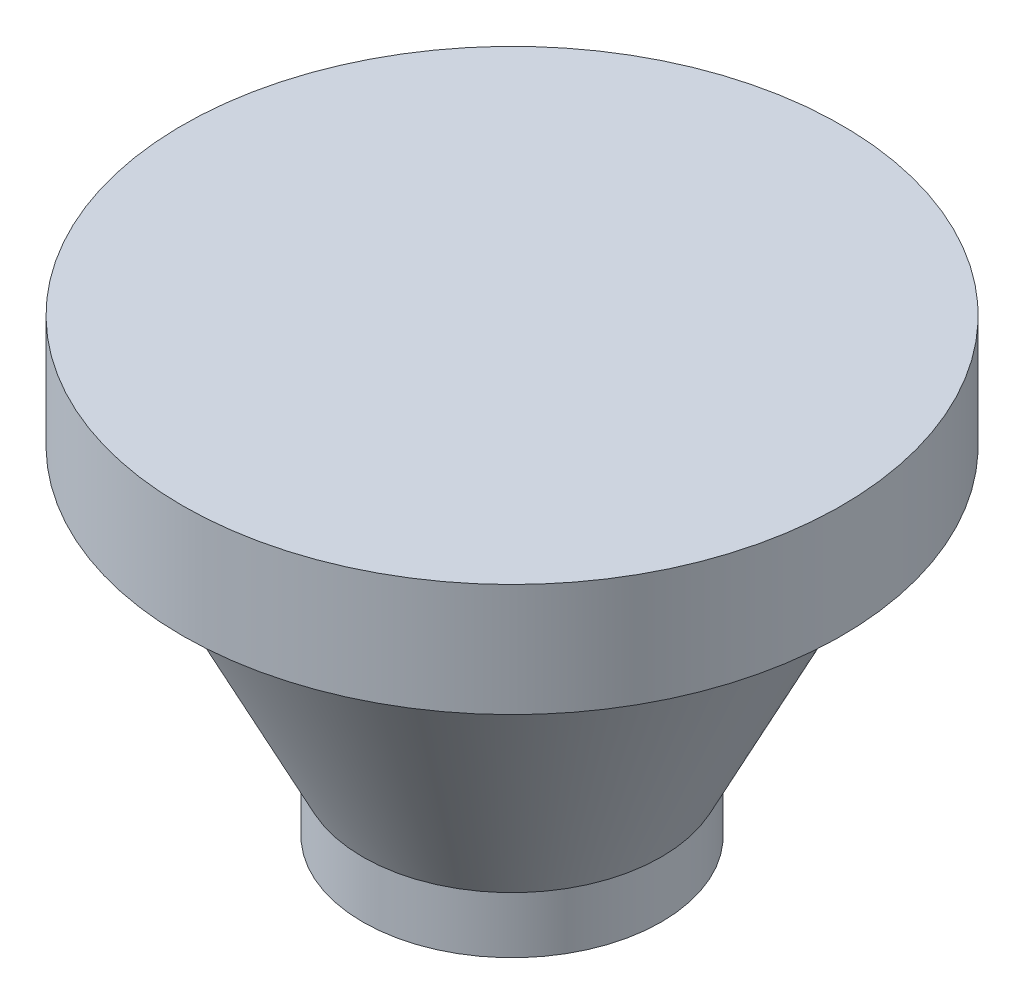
ISO-10303-21;
HEADER;
FILE_DESCRIPTION(('STEP AP214'),'2;1');
FILE_NAME('part.step','',(''),(''),'','','');
FILE_SCHEMA(('AUTOMOTIVE_DESIGN { 1 0 10303 214 1 1 1 1 }'));
ENDSEC;
DATA;
#1=APPLICATION_CONTEXT('core data for automotive mechanical design processes');
#2=APPLICATION_PROTOCOL_DEFINITION('international standard','automotive_design',2000,#1);
#3=PRODUCT_CONTEXT('',#1,'mechanical');
#4=PRODUCT('Part','Part','',(#3));
#5=PRODUCT_RELATED_PRODUCT_CATEGORY('part','',(#4));
#6=PRODUCT_DEFINITION_FORMATION('','',#4);
#7=PRODUCT_DEFINITION_CONTEXT('part definition',#1,'design');
#8=PRODUCT_DEFINITION('design','',#6,#7);
#9=PRODUCT_DEFINITION_SHAPE('','',#8);
#10=(LENGTH_UNIT() NAMED_UNIT(*) SI_UNIT(.MILLI.,.METRE.));
#11=(NAMED_UNIT(*) PLANE_ANGLE_UNIT() SI_UNIT($,.RADIAN.));
#12=(NAMED_UNIT(*) SI_UNIT($,.STERADIAN.) SOLID_ANGLE_UNIT());
#13=UNCERTAINTY_MEASURE_WITH_UNIT(LENGTH_MEASURE(1.E-05),#10,'distance_accuracy_value','');
#14=(GEOMETRIC_REPRESENTATION_CONTEXT(3) GLOBAL_UNCERTAINTY_ASSIGNED_CONTEXT((#13)) GLOBAL_UNIT_ASSIGNED_CONTEXT((#10,
#11,#12)) REPRESENTATION_CONTEXT('',''));
#15=CARTESIAN_POINT('',(0.,0.,0.));
#16=DIRECTION('',(0.,0.,1.));
#17=DIRECTION('',(1.,0.,0.));
#18=AXIS2_PLACEMENT_3D('',#15,#16,#17);
#19=CARTESIAN_POINT('',(0.,0.,0.));
#20=DIRECTION('',(0.,1.,0.));
#21=DIRECTION('',(0.,0.,1.));
#22=AXIS2_PLACEMENT_3D('',#19,#20,#21);
#23=PLANE('',#22);
#24=CARTESIAN_POINT('',(0.,0.,0.));
#25=DIRECTION('',(0.,1.,0.));
#26=DIRECTION('',(0.,0.,1.));
#27=AXIS2_PLACEMENT_3D('',#24,#25,#26);
#28=CIRCLE('',#27,5.3);
#29=CARTESIAN_POINT('',(0.,0.,5.3));
#30=VERTEX_POINT('',#29);
#31=EDGE_CURVE('E10',#30,#30,#28,.T.);
#32=ORIENTED_EDGE('',*,*,#31,.F.);
#33=EDGE_LOOP('',(#32));
#34=FACE_BOUND('',#33,.T.);
#35=ADVANCED_FACE('F35',(#34),#23,.F.);
#36=CARTESIAN_POINT('',(0.,16.,0.));
#37=DIRECTION('',(0.,1.,0.));
#38=DIRECTION('',(0.,0.,1.));
#39=AXIS2_PLACEMENT_3D('',#36,#37,#38);
#40=CYLINDRICAL_SURFACE('',#39,5.3);
#41=CARTESIAN_POINT('',(0.,2.,0.));
#42=DIRECTION('',(0.,1.,0.));
#43=DIRECTION('',(0.,0.,1.));
#44=AXIS2_PLACEMENT_3D('',#41,#42,#43);
#45=CIRCLE('',#44,5.3);
#46=CARTESIAN_POINT('',(0.,2.,5.3));
#47=VERTEX_POINT('',#46);
#48=EDGE_CURVE('E41',#47,#47,#45,.T.);
#49=ORIENTED_EDGE('',*,*,#48,.F.);
#50=EDGE_LOOP('',(#49));
#51=FACE_BOUND('',#50,.T.);
#52=ORIENTED_EDGE('',*,*,#31,.T.);
#53=EDGE_LOOP('',(#52));
#54=FACE_BOUND('',#53,.T.);
#55=ADVANCED_FACE('F74',(#51,#54),#40,.T.);
#56=CARTESIAN_POINT('',(0.,2.,0.));
#57=DIRECTION('',(0.,1.,0.));
#58=DIRECTION('',(0.,0.,1.));
#59=AXIS2_PLACEMENT_3D('',#56,#57,#58);
#60=CONICAL_SURFACE('',#59,5.3,0.463647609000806);
#61=CARTESIAN_POINT('',(0.,12.,0.));
#62=DIRECTION('',(0.,1.,0.));
#63=DIRECTION('',(0.,0.,1.));
#64=AXIS2_PLACEMENT_3D('',#61,#62,#63);
#65=CIRCLE('',#64,10.3);
#66=CARTESIAN_POINT('',(0.,12.,10.3));
#67=VERTEX_POINT('',#66);
#68=EDGE_CURVE('E45',#67,#67,#65,.T.);
#69=ORIENTED_EDGE('',*,*,#68,.F.);
#70=EDGE_LOOP('',(#69));
#71=FACE_BOUND('',#70,.T.);
#72=ORIENTED_EDGE('',*,*,#48,.T.);
#73=EDGE_LOOP('',(#72));
#74=FACE_BOUND('',#73,.T.);
#75=ADVANCED_FACE('F69',(#71,#74),#60,.T.);
#76=CARTESIAN_POINT('',(0.,12.,-10.3));
#77=DIRECTION('',(0.,1.,0.));
#78=DIRECTION('',(0.,0.,1.));
#79=AXIS2_PLACEMENT_3D('',#76,#77,#78);
#80=PLANE('',#79);
#81=CARTESIAN_POINT('',(0.,12.,0.));
#82=DIRECTION('',(0.,1.,0.));
#83=DIRECTION('',(0.,0.,1.));
#84=AXIS2_PLACEMENT_3D('',#81,#82,#83);
#85=CIRCLE('',#84,11.7);
#86=CARTESIAN_POINT('',(0.,12.,11.7));
#87=VERTEX_POINT('',#86);
#88=EDGE_CURVE('E49',#87,#87,#85,.T.);
#89=ORIENTED_EDGE('',*,*,#88,.F.);
#90=EDGE_LOOP('',(#89));
#91=FACE_BOUND('',#90,.T.);
#92=ORIENTED_EDGE('',*,*,#68,.T.);
#93=EDGE_LOOP('',(#92));
#94=FACE_BOUND('',#93,.T.);
#95=ADVANCED_FACE('F63',(#91,#94),#80,.F.);
#96=CARTESIAN_POINT('',(0.,16.,0.));
#97=DIRECTION('',(0.,1.,0.));
#98=DIRECTION('',(0.,0.,1.));
#99=AXIS2_PLACEMENT_3D('',#96,#97,#98);
#100=CYLINDRICAL_SURFACE('',#99,11.7);
#101=CARTESIAN_POINT('',(0.,16.,0.));
#102=DIRECTION('',(0.,1.,0.));
#103=DIRECTION('',(0.,0.,1.));
#104=AXIS2_PLACEMENT_3D('',#101,#102,#103);
#105=CIRCLE('',#104,11.7);
#106=CARTESIAN_POINT('',(0.,16.,11.7));
#107=VERTEX_POINT('',#106);
#108=EDGE_CURVE('E54',#107,#107,#105,.T.);
#109=ORIENTED_EDGE('',*,*,#108,.F.);
#110=EDGE_LOOP('',(#109));
#111=FACE_BOUND('',#110,.T.);
#112=ORIENTED_EDGE('',*,*,#88,.T.);
#113=EDGE_LOOP('',(#112));
#114=FACE_BOUND('',#113,.T.);
#115=ADVANCED_FACE('F60',(#111,#114),#100,.T.);
#116=CARTESIAN_POINT('',(0.,16.,-11.7));
#117=DIRECTION('',(0.,-1.,0.));
#118=DIRECTION('',(0.,0.,-1.));
#119=AXIS2_PLACEMENT_3D('',#116,#117,#118);
#120=PLANE('',#119);
#121=ORIENTED_EDGE('',*,*,#108,.T.);
#122=EDGE_LOOP('',(#121));
#123=FACE_BOUND('',#122,.T.);
#124=ADVANCED_FACE('F58',(#123),#120,.F.);
#125=CLOSED_SHELL('',(#35,#55,#75,#95,#115,#124));
#126=MANIFOLD_SOLID_BREP('B2',#125);
#127=ADVANCED_BREP_SHAPE_REPRESENTATION('',(#18,#126),#14);
#128=SHAPE_DEFINITION_REPRESENTATION(#9,#127);
ENDSEC;
END-ISO-10303-21;
